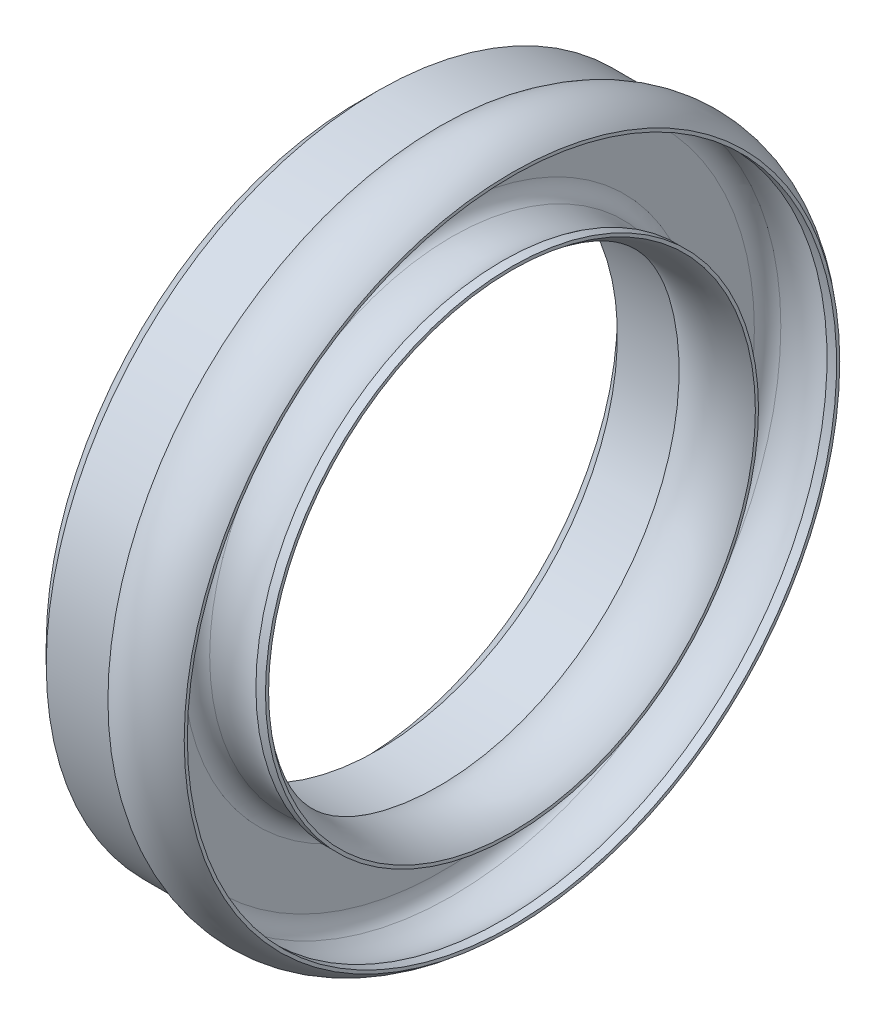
from build123d import *

# Parameters (mm, degrees)
CHAMFER1_SIZE = 0.508


with BuildPart() as part:
    # Sketch1 → Base-Revolve (revolve)
    with BuildSketch(Plane.XY, mode=Mode.PRIVATE) as base_revolve_sk:
        with BuildLine():
            Line((0, 6.6675), (0, 9.2075))
            Line((0, 9.2075), (2.2225, 9.2075))
            ThreePointArc((2.2225, 9.2075), (3.251335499, 9.523163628), (4.24509077, 9.110130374))
            Line((4.24509077, 9.110130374), (4.24509077, 9.023059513))
            Line((4.24509077, 9.023059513), (3.979121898, 9.023059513))
            ThreePointArc((3.979121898, 9.023059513), (3.292669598, 9.283310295), (2.571468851, 9.146136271))
            ThreePointArc((2.571468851, 9.146136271), (2.366355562, 8.958832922), (2.29041658, 8.691648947))
            Line((2.29041658, 8.691648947), (2.29041658, 7.183351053))
            ThreePointArc((2.29041658, 7.183351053), (2.366355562, 6.916167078), (2.571468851, 6.728863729))
            ThreePointArc((2.571468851, 6.728863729), (3.292669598, 6.591689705), (3.979121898, 6.851940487))
            Line((3.979121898, 6.851940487), (4.24509077, 6.851940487))
            Line((4.24509077, 6.851940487), (4.24509077, 6.764869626))
            ThreePointArc((4.24509077, 6.764869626), (3.251335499, 6.351836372), (2.2225, 6.6675))
            Line((2.2225, 6.6675), (0, 6.6675))
        make_face()
    revolve(base_revolve_sk.sketch.rotate(Axis((0, 0, 0), (1, 0, 0)), 90), axis=Axis((0, 0, 0), (1, 0, 0)))

    # Chamfer1
    chamfer1_edges = [part.edges().sort_by_distance(p)[0] for p in [
        (0, 0, -6.6675),
        (0, 0, -9.2075),
    ]]
    chamfer(chamfer1_edges, length=CHAMFER1_SIZE)


solid = part.part
